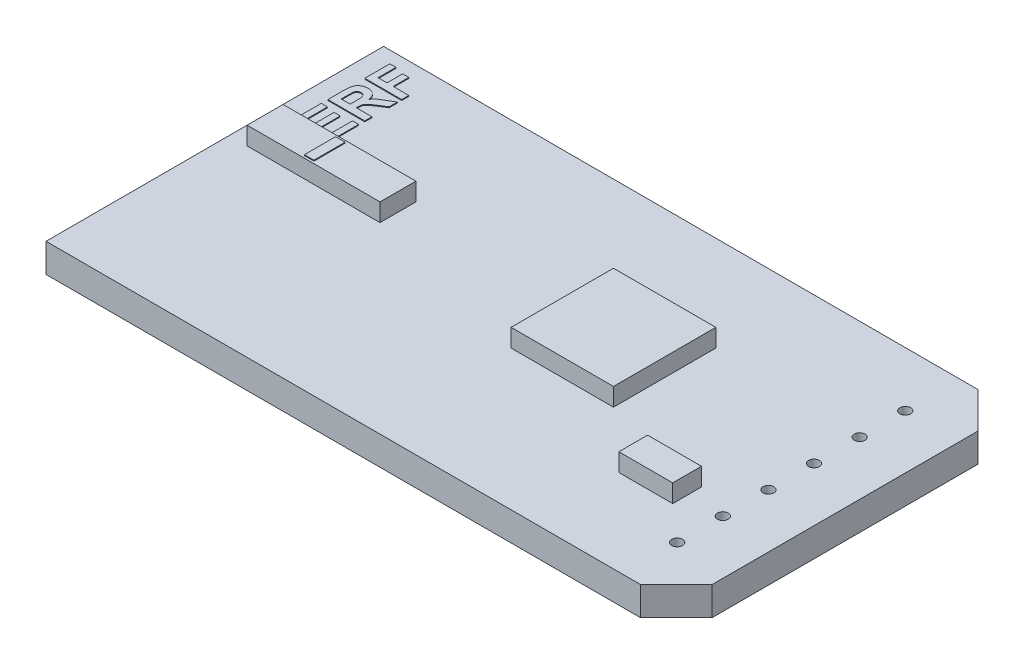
from build123d import *

# Parameters (mm, degrees)
ESQUISSE1_R        = 0.3
BOSS_EXTRU_1_DEPTH = 1.6
ESQUISSE2_W        = 5.7
ESQUISSE2_H        = 5.7
ESQUISSE2_W_2      = 3
ESQUISSE2_H_2      = 1.6
BOSS_EXTRU_2_DEPTH = 1
ESQUISSE3_W        = 7.4
ESQUISSE3_H        = 2
BOSS_EXTRU_5_DEPTH = 1
BOSS_EXTRU_4_DEPTH = 0.05
ESQUISSE6_W        = 0.529488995
ESQUISSE6_H        = 1.731870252
BOSS_EXTRU_6_DEPTH = 0.05


with BuildPart() as part:
    # Esquisse1 → Boss.-Extru.1 (new body)
    with BuildSketch(Plane(origin=(0, 0, 0), x_dir=(1, 0, 0), z_dir=(0, 1, 0))):
        Polygon((0, 18.8), (33.1, 18.8), (35.1, 16.8), (35.1, 2), (33.1, 0), (0, 0), align=None)
        with Locations(Location((32.1, 10.67, 0), (0, 0, 270))):
            Circle(ESQUISSE1_R, mode=Mode.SUBTRACT)
        with Locations(Location((32.1, 13.21, 0), (0, 0, 270))):
            Circle(ESQUISSE1_R, mode=Mode.SUBTRACT)
        with Locations(Location((32.1, 15.75, 0), (0, 0, 270))):
            Circle(ESQUISSE1_R, mode=Mode.SUBTRACT)
        with Locations(Location((32.1, 3.05, 0), (0, 0, 90))):
            Circle(ESQUISSE1_R, mode=Mode.SUBTRACT)
        with Locations(Location((32.1, 5.59, 0), (0, 0, 90))):
            Circle(ESQUISSE1_R, mode=Mode.SUBTRACT)
        with Locations(Location((32.1, 8.13, 0), (0, 0, 90))):
            Circle(ESQUISSE1_R, mode=Mode.SUBTRACT)
    extrude(amount=BOSS_EXTRU_1_DEPTH)

    # Esquisse2 → Boss.-Extru.2 (add)
    with BuildSketch(Plane(origin=(0, 1.6, 0), x_dir=(1, 0, 0), z_dir=(0, 1, 0))):
        with Locations((20.95, 10.65)):
            Rectangle(ESQUISSE2_W, ESQUISSE2_H)
        with Locations((28.6, 5.6)):
            Rectangle(ESQUISSE2_W_2, ESQUISSE2_H_2)
    extrude(amount=BOSS_EXTRU_2_DEPTH)

    # Esquisse3 → Boss.-Extru.5 (add)
    with BuildSketch(Plane(origin=(0, 1.6, 0), x_dir=(1, 0, 0), z_dir=(0, 1, 0))):
        with Locations((4.7, 11.2)):
            Rectangle(ESQUISSE3_W, ESQUISSE3_H)
    extrude(amount=BOSS_EXTRU_5_DEPTH)

    # Esquisse5 → Boss.-Extru.4 (add)
    # profile 1 of 3: a face of its own
    with BuildSketch(Plane(origin=(0, 1.6, 0), x_dir=(1, 0, 0), z_dir=(0, 1, 0))):
        Polygon((3.117752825, 12.738835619), (1.063097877, 12.738835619), (1.063097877, 14.266655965), (1.405540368, 14.266655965), (1.405540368, 13.133961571), (1.85334978, 13.133961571), (1.85334978, 14.187630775), (2.195792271, 14.187630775), (2.195792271, 13.133961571), (2.775310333, 13.133961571), (2.775310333, 14.292997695), (3.117752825, 14.292997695), align=None)
    # profile 2 of 3: a face of its own
    with BuildSketch(Plane(origin=(0, 1.6, 0), x_dir=(1, 0, 0), z_dir=(0, 1, 0))):
        with BuildLine():
            Line((3.117752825, 14.635440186), (1.063097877, 14.635440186))
            Line((1.063097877, 14.635440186), (1.063097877, 15.497720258))
            add(Edge.make_bspline(
                [(1.063097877, 15.497720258), (1.063259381, 15.523925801), (1.063570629, 15.57442868), (1.065840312, 15.647465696), (1.070595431, 15.714822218), (1.075980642, 15.776797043), (1.083815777, 15.8330925), (1.093202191, 15.883931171), (1.104079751, 15.929227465), (1.117107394, 15.969642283), (1.132017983, 16.006492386), (1.149765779, 16.040820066), (1.170559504, 16.073002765), (1.193682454, 16.103534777), (1.21917016, 16.132545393), (1.247697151, 16.159239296), (1.278838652, 16.184081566), (1.312335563, 16.207052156), (1.348039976, 16.227287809), (1.384805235, 16.245777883), (1.423022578, 16.2608295), (1.462511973, 16.273261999), (1.503187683, 16.283193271), (1.54515312, 16.290086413), (1.588332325, 16.294389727), (1.617498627, 16.294773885), (1.632326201, 16.294969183)],
                knots=[0, 0, 0, 0, 1.675828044, 3.229627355, 4.67171229, 5.993455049, 7.206927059, 8.304770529, 9.29850117, 10.183580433, 11.017754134, 11.837875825, 12.650738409, 13.464925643, 14.285328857, 15.117007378, 15.959673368, 16.830859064, 17.711229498, 18.58228265, 19.460420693, 20.334473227, 21.228207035, 22.135446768, 23.052097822, 24, 24, 24, 24], degree=3))
            add(Edge.make_bspline(
                [(1.632326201, 16.294969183), (1.651004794, 16.294606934), (1.687507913, 16.293899), (1.741010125, 16.28738422), (1.79212767, 16.277708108), (1.840931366, 16.263914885), (1.886847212, 16.244949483), (1.930518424, 16.222932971), (1.971796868, 16.19667458), (2.010273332, 16.16635271), (2.045981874, 16.131994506), (2.078187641, 16.093449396), (2.107016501, 16.050992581), (2.132302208, 16.004367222), (2.153918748, 15.953897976), (2.172106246, 15.899365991), (2.186908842, 15.841018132), (2.193873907, 15.800431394), (2.197438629, 15.779659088)],
                knots=[0, 0, 0, 0, 1.05911256, 2.069797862, 3.05271628, 4.008392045, 4.940519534, 5.866323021, 6.779546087, 7.71056835, 8.640711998, 9.585328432, 10.554502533, 11.547017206, 12.589327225, 13.664782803, 14.804835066, 16, 16, 16, 16], degree=3))
            add(Edge.make_bspline(
                [(2.197438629, 15.779659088), (2.210747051, 15.799744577), (2.236793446, 15.839054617), (2.27963732, 15.893504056), (2.324742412, 15.942084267), (2.364292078, 15.979621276), (2.399861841, 16.007413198), (2.430308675, 16.030727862), (2.465809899, 16.055333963), (2.506182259, 16.081348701), (2.550628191, 16.110065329), (2.600039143, 16.139876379), (2.653934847, 16.171617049), (2.69158799, 16.192951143), (2.711102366, 16.204007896)],
                knots=[0, 0, 0, 0, 1.285380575, 2.515664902, 3.691712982, 4.8210066, 5.420125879, 6.099525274, 6.867223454, 7.724129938, 8.662395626, 9.690709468, 10.80317128, 12, 12, 12, 12], degree=3))
            Line((2.711102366, 16.204007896), (3.117752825, 16.453019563))
            Line((3.117752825, 16.453019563), (3.117752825, 15.991216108))
            Line((3.117752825, 15.991216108), (2.651421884, 15.698987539))
            add(Edge.make_bspline(
                [(2.651421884, 15.698987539), (2.632742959, 15.6855702), (2.59708105, 15.65995374), (2.546446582, 15.622919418), (2.501316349, 15.58929125), (2.461475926, 15.559039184), (2.42700228, 15.532210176), (2.398305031, 15.508165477), (2.374436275, 15.488158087), (2.350822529, 15.465470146), (2.326405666, 15.439277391), (2.303486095, 15.406217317), (2.284050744, 15.373096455), (2.269861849, 15.337021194), (2.259817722, 15.295518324), (2.253469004, 15.245578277), (2.248765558, 15.185686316), (2.248577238, 15.142393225), (2.248475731, 15.119057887)],
                knots=[0, 0, 0, 0, 1.46553183, 2.798001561, 3.997495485, 5.051879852, 5.985828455, 6.78059074, 7.437743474, 7.969536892, 8.866966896, 9.713558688, 10.527938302, 11.308826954, 12.173949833, 13.242197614, 14.513521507, 16, 16, 16, 16], degree=3))
            Line((2.248475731, 15.119057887), (2.248475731, 15.030566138))
            Line((2.248475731, 15.030566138), (3.117752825, 15.030566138))
            Line((3.117752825, 15.030566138), (3.117752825, 14.635440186))
        make_face()
        with BuildLine():
            Line((1.90603324, 15.030566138), (1.90603324, 15.348724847))
            add(Edge.make_bspline(
                [(1.90603324, 15.348724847), (1.905980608, 15.373284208), (1.905880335, 15.420073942), (1.904427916, 15.486609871), (1.90319517, 15.546048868), (1.900097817, 15.598035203), (1.897028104, 15.642801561), (1.893038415, 15.68016809), (1.888323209, 15.710450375), (1.880990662, 15.740695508), (1.868223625, 15.771686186), (1.85000508, 15.804677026), (1.826427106, 15.833090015), (1.798798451, 15.857100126), (1.767013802, 15.876161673), (1.731602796, 15.890601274), (1.692037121, 15.898042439), (1.664593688, 15.89923039), (1.65043614, 15.899843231)],
                knots=[0, 0, 0, 0, 1.698057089, 3.235085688, 4.601626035, 5.808202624, 6.835519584, 7.703960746, 8.405747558, 8.953324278, 9.851713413, 10.714175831, 11.549823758, 12.390464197, 13.233189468, 14.101630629, 15.020667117, 16, 16, 16, 16], degree=3))
            add(Edge.make_bspline(
                [(1.65043614, 15.899843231), (1.634597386, 15.899149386), (1.604039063, 15.897810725), (1.560473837, 15.887050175), (1.521848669, 15.868661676), (1.488342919, 15.843146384), (1.460596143, 15.810833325), (1.438149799, 15.772831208), (1.421507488, 15.728793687), (1.41534587, 15.697053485), (1.412125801, 15.68046601)],
                knots=[0, 0, 0, 0, 1.062681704, 2.050272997, 2.989771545, 3.916582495, 4.856893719, 5.831726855, 6.866857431, 8, 8, 8, 8], degree=3))
            add(Edge.make_bspline(
                [(1.412125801, 15.68046601), (1.411523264, 15.674982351), (1.410095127, 15.661984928), (1.409177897, 15.63903302), (1.407768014, 15.60968606), (1.407191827, 15.573588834), (1.406181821, 15.531063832), (1.405996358, 15.481941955), (1.405403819, 15.426379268), (1.405493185, 15.387140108), (1.405540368, 15.366423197)],
                knots=[0, 0, 0, 0, 0.42127143, 0.998501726, 1.753681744, 2.66564073, 3.755712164, 5.002818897, 6.417592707, 8, 8, 8, 8], degree=3))
            Line((1.405540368, 15.366423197), (1.405540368, 15.030566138))
            Line((1.405540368, 15.030566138), (1.90603324, 15.030566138))
        make_face(mode=Mode.SUBTRACT)
    # profile 3 of 3: a face of its own
    with BuildSketch(Plane(origin=(0, 1.6, 0), x_dir=(1, 0, 0), z_dir=(0, 1, 0))):
        Polygon((3.117752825, 16.690095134), (1.063097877, 16.690095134), (1.063097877, 18.08620683), (1.405540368, 18.08620683), (1.405540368, 17.085221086), (1.90603324, 17.085221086), (1.90603324, 17.954498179), (2.248475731, 17.954498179), (2.248475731, 17.085221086), (3.117752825, 17.085221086), align=None)
    extrude(amount=BOSS_EXTRU_4_DEPTH)

    # Esquisse6 → Boss.-Extru.6 (add)
    with BuildSketch(Plane(origin=(0, 2.6, 0), x_dir=(1, 0, 0), z_dir=(0, 1, 0))):
        with Locations((4.331761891, 11.191373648)):
            Rectangle(ESQUISSE6_W, ESQUISSE6_H)
    extrude(amount=BOSS_EXTRU_6_DEPTH)


solid = part.part
